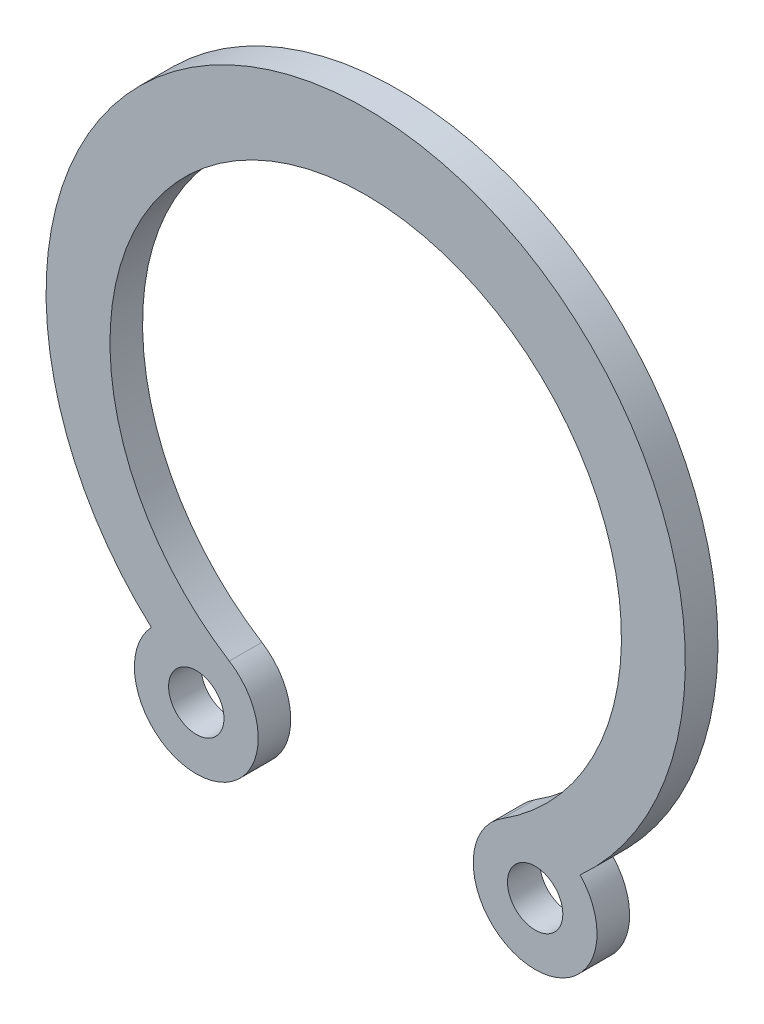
ISO-10303-21;
HEADER;
FILE_DESCRIPTION(('STEP AP214'),'2;1');
FILE_NAME('part.step','',(''),(''),'','','');
FILE_SCHEMA(('AUTOMOTIVE_DESIGN { 1 0 10303 214 1 1 1 1 }'));
ENDSEC;
DATA;
#1=APPLICATION_CONTEXT('core data for automotive mechanical design processes');
#2=APPLICATION_PROTOCOL_DEFINITION('international standard','automotive_design',2000,#1);
#3=PRODUCT_CONTEXT('',#1,'mechanical');
#4=PRODUCT('Part','Part','',(#3));
#5=PRODUCT_RELATED_PRODUCT_CATEGORY('part','',(#4));
#6=PRODUCT_DEFINITION_FORMATION('','',#4);
#7=PRODUCT_DEFINITION_CONTEXT('part definition',#1,'design');
#8=PRODUCT_DEFINITION('design','',#6,#7);
#9=PRODUCT_DEFINITION_SHAPE('','',#8);
#10=(LENGTH_UNIT() NAMED_UNIT(*) SI_UNIT(.MILLI.,.METRE.));
#11=(NAMED_UNIT(*) PLANE_ANGLE_UNIT() SI_UNIT($,.RADIAN.));
#12=(NAMED_UNIT(*) SI_UNIT($,.STERADIAN.) SOLID_ANGLE_UNIT());
#13=UNCERTAINTY_MEASURE_WITH_UNIT(LENGTH_MEASURE(1.E-05),#10,'distance_accuracy_value','');
#14=(GEOMETRIC_REPRESENTATION_CONTEXT(3) GLOBAL_UNCERTAINTY_ASSIGNED_CONTEXT((#13)) GLOBAL_UNIT_ASSIGNED_CONTEXT((#10,
#11,#12)) REPRESENTATION_CONTEXT('',''));
#15=CARTESIAN_POINT('',(0.,0.,0.));
#16=DIRECTION('',(0.,0.,1.));
#17=DIRECTION('',(1.,0.,0.));
#18=AXIS2_PLACEMENT_3D('',#15,#16,#17);
#19=CARTESIAN_POINT('',(12.0903000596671,14.4015504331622,-1.));
#20=DIRECTION('',(0.,0.,-1.));
#21=DIRECTION('',(-1.,0.,0.));
#22=AXIS2_PLACEMENT_3D('',#19,#20,#21);
#23=PLANE('',#22);
#24=CARTESIAN_POINT('',(5.0155460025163,17.158679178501,-1.));
#25=DIRECTION('',(0.,0.,1.));
#26=DIRECTION('',(1.,0.,0.));
#27=AXIS2_PLACEMENT_3D('',#24,#25,#26);
#28=CIRCLE('',#27,0.850000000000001);
#29=CARTESIAN_POINT('',(5.8655460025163,17.158679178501,-1.));
#30=VERTEX_POINT('',#29);
#31=EDGE_CURVE('E95',#30,#30,#28,.F.);
#32=ORIENTED_EDGE('',*,*,#31,.F.);
#33=EDGE_LOOP('',(#32));
#34=FACE_BOUND('',#33,.T.);
#35=CARTESIAN_POINT('',(-5.3859505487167,17.158679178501,-1.));
#36=DIRECTION('',(0.,0.,-1.));
#37=DIRECTION('',(-1.,0.,0.));
#38=AXIS2_PLACEMENT_3D('',#35,#36,#37);
#39=CIRCLE('',#38,0.85);
#40=CARTESIAN_POINT('',(-6.2359505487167,17.158679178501,-1.));
#41=VERTEX_POINT('',#40);
#42=EDGE_CURVE('E98',#41,#41,#39,.T.);
#43=ORIENTED_EDGE('',*,*,#42,.F.);
#44=EDGE_LOOP('',(#43));
#45=FACE_BOUND('',#44,.T.);
#46=CARTESIAN_POINT('',(5.0155460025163,17.158679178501,-1.));
#47=DIRECTION('',(0.,0.,-1.));
#48=DIRECTION('',(-1.,0.,0.));
#49=AXIS2_PLACEMENT_3D('',#46,#47,#48);
#50=CIRCLE('',#49,1.90000000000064);
#51=CARTESIAN_POINT('',(6.39556834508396,18.4646417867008,-1.));
#52=VERTEX_POINT('',#51);
#53=CARTESIAN_POINT('',(4.00206685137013,18.7658070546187,-1.));
#54=VERTEX_POINT('',#53);
#55=EDGE_CURVE('E60',#52,#54,#50,.T.);
#56=ORIENTED_EDGE('',*,*,#55,.T.);
#57=CARTESIAN_POINT('',(-0.18520227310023,25.405782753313,-1.));
#58=DIRECTION('',(0.,0.,-1.));
#59=DIRECTION('',(-1.,0.,0.));
#60=AXIS2_PLACEMENT_3D('',#57,#58,#59);
#61=CIRCLE('',#60,7.85);
#62=CARTESIAN_POINT('',(-4.37247139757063,18.7658070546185,-1.));
#63=VERTEX_POINT('',#62);
#64=EDGE_CURVE('E57',#63,#54,#61,.T.);
#65=ORIENTED_EDGE('',*,*,#64,.F.);
#66=CARTESIAN_POINT('',(-5.3859505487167,17.158679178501,-1.));
#67=DIRECTION('',(0.,0.,1.));
#68=DIRECTION('',(1.,0.,0.));
#69=AXIS2_PLACEMENT_3D('',#66,#67,#68);
#70=CIRCLE('',#69,1.90000000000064);
#71=CARTESIAN_POINT('',(-6.76597289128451,18.4646417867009,-1.));
#72=VERTEX_POINT('',#71);
#73=EDGE_CURVE('E21',#63,#72,#70,.F.);
#74=ORIENTED_EDGE('',*,*,#73,.T.);
#75=CARTESIAN_POINT('',(-0.18520227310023,25.743282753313,-1.));
#76=DIRECTION('',(0.,0.,1.));
#77=DIRECTION('',(1.,0.,0.));
#78=AXIS2_PLACEMENT_3D('',#75,#76,#77);
#79=CIRCLE('',#78,9.81250000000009);
#80=EDGE_CURVE('E103',#72,#52,#79,.F.);
#81=ORIENTED_EDGE('',*,*,#80,.T.);
#82=EDGE_LOOP('',(#56,#65,#74,#81));
#83=FACE_BOUND('',#82,.T.);
#84=ADVANCED_FACE('F17',(#34,#45,#83),#23,.T.);
#85=CARTESIAN_POINT('',(-5.3859505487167,17.158679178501,-1.));
#86=DIRECTION('',(0.,0.,1.));
#87=DIRECTION('',(1.,0.,0.));
#88=AXIS2_PLACEMENT_3D('',#85,#86,#87);
#89=CYLINDRICAL_SURFACE('',#88,1.90000000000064);
#90=DIRECTION('',(0.,0.,-1.));
#91=VECTOR('',#90,1.);
#92=CARTESIAN_POINT('',(-6.76597289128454,18.4646417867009,-0.5));
#93=LINE('',#92,#91);
#94=CARTESIAN_POINT('',(-6.76597289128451,18.4646417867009,0.));
#95=VERTEX_POINT('',#94);
#96=EDGE_CURVE('E71',#95,#72,#93,.T.);
#97=ORIENTED_EDGE('',*,*,#96,.T.);
#98=ORIENTED_EDGE('',*,*,#73,.F.);
#99=DIRECTION('',(0.,0.,-1.));
#100=VECTOR('',#99,1.);
#101=CARTESIAN_POINT('',(-4.37247139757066,18.7658070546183,-0.5));
#102=LINE('',#101,#100);
#103=CARTESIAN_POINT('',(-4.37247139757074,18.7658070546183,0.));
#104=VERTEX_POINT('',#103);
#105=EDGE_CURVE('E65',#104,#63,#102,.T.);
#106=ORIENTED_EDGE('',*,*,#105,.F.);
#107=CARTESIAN_POINT('',(-5.3859505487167,17.158679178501,0.));
#108=DIRECTION('',(0.,0.,1.));
#109=DIRECTION('',(1.,0.,0.));
#110=AXIS2_PLACEMENT_3D('',#107,#108,#109);
#111=CIRCLE('',#110,1.90000000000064);
#112=EDGE_CURVE('E93',#95,#104,#111,.T.);
#113=ORIENTED_EDGE('',*,*,#112,.F.);
#114=EDGE_LOOP('',(#97,#98,#106,#113));
#115=FACE_BOUND('',#114,.T.);
#116=ADVANCED_FACE('F67',(#115),#89,.T.);
#117=CARTESIAN_POINT('',(-0.18520227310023,25.405782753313,0.));
#118=DIRECTION('',(0.,0.,-1.));
#119=DIRECTION('',(-1.,0.,0.));
#120=AXIS2_PLACEMENT_3D('',#117,#118,#119);
#121=CYLINDRICAL_SURFACE('',#120,7.85);
#122=ORIENTED_EDGE('',*,*,#64,.T.);
#123=DIRECTION('',(0.,0.,1.));
#124=VECTOR('',#123,1.);
#125=CARTESIAN_POINT('',(4.00206685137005,18.7658070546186,-0.5));
#126=LINE('',#125,#124);
#127=CARTESIAN_POINT('',(4.00206685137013,18.7658070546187,0.));
#128=VERTEX_POINT('',#127);
#129=EDGE_CURVE('E78',#54,#128,#126,.T.);
#130=ORIENTED_EDGE('',*,*,#129,.T.);
#131=CARTESIAN_POINT('',(-0.18520227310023,25.405782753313,0.));
#132=DIRECTION('',(0.,0.,-1.));
#133=DIRECTION('',(-1.,0.,0.));
#134=AXIS2_PLACEMENT_3D('',#131,#132,#133);
#135=CIRCLE('',#134,7.85);
#136=EDGE_CURVE('E74',#104,#128,#135,.T.);
#137=ORIENTED_EDGE('',*,*,#136,.F.);
#138=ORIENTED_EDGE('',*,*,#105,.T.);
#139=EDGE_LOOP('',(#122,#130,#137,#138));
#140=FACE_BOUND('',#139,.T.);
#141=ADVANCED_FACE('F73',(#140),#121,.F.);
#142=CARTESIAN_POINT('',(5.0155460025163,17.158679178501,0.));
#143=DIRECTION('',(0.,0.,-1.));
#144=DIRECTION('',(-1.,0.,0.));
#145=AXIS2_PLACEMENT_3D('',#142,#143,#144);
#146=CYLINDRICAL_SURFACE('',#145,1.90000000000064);
#147=ORIENTED_EDGE('',*,*,#55,.F.);
#148=DIRECTION('',(0.,0.,1.));
#149=VECTOR('',#148,1.);
#150=CARTESIAN_POINT('',(6.39556834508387,18.4646417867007,-0.5));
#151=LINE('',#150,#149);
#152=CARTESIAN_POINT('',(6.39556834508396,18.4646417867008,0.));
#153=VERTEX_POINT('',#152);
#154=EDGE_CURVE('E36',#52,#153,#151,.T.);
#155=ORIENTED_EDGE('',*,*,#154,.T.);
#156=CARTESIAN_POINT('',(5.0155460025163,17.158679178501,0.));
#157=DIRECTION('',(0.,0.,-1.));
#158=DIRECTION('',(-1.,0.,0.));
#159=AXIS2_PLACEMENT_3D('',#156,#157,#158);
#160=CIRCLE('',#159,1.90000000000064);
#161=EDGE_CURVE('E89',#128,#153,#160,.F.);
#162=ORIENTED_EDGE('',*,*,#161,.F.);
#163=ORIENTED_EDGE('',*,*,#129,.F.);
#164=EDGE_LOOP('',(#147,#155,#162,#163));
#165=FACE_BOUND('',#164,.T.);
#166=ADVANCED_FACE('F108',(#165),#146,.T.);
#167=CARTESIAN_POINT('',(-0.18520227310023,25.743282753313,-1.));
#168=DIRECTION('',(0.,0.,1.));
#169=DIRECTION('',(1.,0.,0.));
#170=AXIS2_PLACEMENT_3D('',#167,#168,#169);
#171=CYLINDRICAL_SURFACE('',#170,9.81250000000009);
#172=ORIENTED_EDGE('',*,*,#96,.F.);
#173=CARTESIAN_POINT('',(-0.18520227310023,25.743282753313,0.));
#174=DIRECTION('',(0.,0.,1.));
#175=DIRECTION('',(1.,0.,0.));
#176=AXIS2_PLACEMENT_3D('',#173,#174,#175);
#177=CIRCLE('',#176,9.81250000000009);
#178=EDGE_CURVE('E85',#153,#95,#177,.T.);
#179=ORIENTED_EDGE('',*,*,#178,.F.);
#180=ORIENTED_EDGE('',*,*,#154,.F.);
#181=ORIENTED_EDGE('',*,*,#80,.F.);
#182=EDGE_LOOP('',(#172,#179,#180,#181));
#183=FACE_BOUND('',#182,.T.);
#184=ADVANCED_FACE('F111',(#183),#171,.T.);
#185=CARTESIAN_POINT('',(-5.3859505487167,17.158679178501,0.));
#186=DIRECTION('',(0.,0.,-1.));
#187=DIRECTION('',(-1.,0.,0.));
#188=AXIS2_PLACEMENT_3D('',#185,#186,#187);
#189=CYLINDRICAL_SURFACE('',#188,0.85);
#190=ORIENTED_EDGE('',*,*,#42,.T.);
#191=EDGE_LOOP('',(#190));
#192=FACE_BOUND('',#191,.T.);
#193=CARTESIAN_POINT('',(-5.3859505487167,17.158679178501,0.));
#194=DIRECTION('',(0.,0.,-1.));
#195=DIRECTION('',(-1.,0.,0.));
#196=AXIS2_PLACEMENT_3D('',#193,#194,#195);
#197=CIRCLE('',#196,0.85);
#198=CARTESIAN_POINT('',(-6.2359505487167,17.158679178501,0.));
#199=VERTEX_POINT('',#198);
#200=EDGE_CURVE('E27',#199,#199,#197,.T.);
#201=ORIENTED_EDGE('',*,*,#200,.F.);
#202=EDGE_LOOP('',(#201));
#203=FACE_BOUND('',#202,.T.);
#204=ADVANCED_FACE('F113',(#192,#203),#189,.F.);
#205=CARTESIAN_POINT('',(5.0155460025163,17.158679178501,-1.));
#206=DIRECTION('',(0.,0.,1.));
#207=DIRECTION('',(1.,0.,0.));
#208=AXIS2_PLACEMENT_3D('',#205,#206,#207);
#209=CYLINDRICAL_SURFACE('',#208,0.850000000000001);
#210=ORIENTED_EDGE('',*,*,#31,.T.);
#211=EDGE_LOOP('',(#210));
#212=FACE_BOUND('',#211,.T.);
#213=CARTESIAN_POINT('',(5.0155460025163,17.158679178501,0.));
#214=DIRECTION('',(0.,0.,1.));
#215=DIRECTION('',(1.,0.,0.));
#216=AXIS2_PLACEMENT_3D('',#213,#214,#215);
#217=CIRCLE('',#216,0.850000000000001);
#218=CARTESIAN_POINT('',(5.8655460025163,17.158679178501,0.));
#219=VERTEX_POINT('',#218);
#220=EDGE_CURVE('E11',#219,#219,#217,.F.);
#221=ORIENTED_EDGE('',*,*,#220,.F.);
#222=EDGE_LOOP('',(#221));
#223=FACE_BOUND('',#222,.T.);
#224=ADVANCED_FACE('F120',(#212,#223),#209,.F.);
#225=CARTESIAN_POINT('',(-13.2033553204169,14.4015504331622,0.));
#226=DIRECTION('',(0.,0.,1.));
#227=DIRECTION('',(1.,0.,0.));
#228=AXIS2_PLACEMENT_3D('',#225,#226,#227);
#229=PLANE('',#228);
#230=ORIENTED_EDGE('',*,*,#220,.T.);
#231=EDGE_LOOP('',(#230));
#232=FACE_BOUND('',#231,.T.);
#233=ORIENTED_EDGE('',*,*,#200,.T.);
#234=EDGE_LOOP('',(#233));
#235=FACE_BOUND('',#234,.T.);
#236=ORIENTED_EDGE('',*,*,#178,.T.);
#237=ORIENTED_EDGE('',*,*,#112,.T.);
#238=ORIENTED_EDGE('',*,*,#136,.T.);
#239=ORIENTED_EDGE('',*,*,#161,.T.);
#240=EDGE_LOOP('',(#236,#237,#238,#239));
#241=FACE_BOUND('',#240,.T.);
#242=ADVANCED_FACE('F19',(#232,#235,#241),#229,.T.);
#243=CLOSED_SHELL('',(#84,#116,#141,#166,#184,#204,#224,#242));
#244=MANIFOLD_SOLID_BREP('B1',#243);
#245=ADVANCED_BREP_SHAPE_REPRESENTATION('',(#18,#244),#14);
#246=SHAPE_DEFINITION_REPRESENTATION(#9,#245);
ENDSEC;
END-ISO-10303-21;
